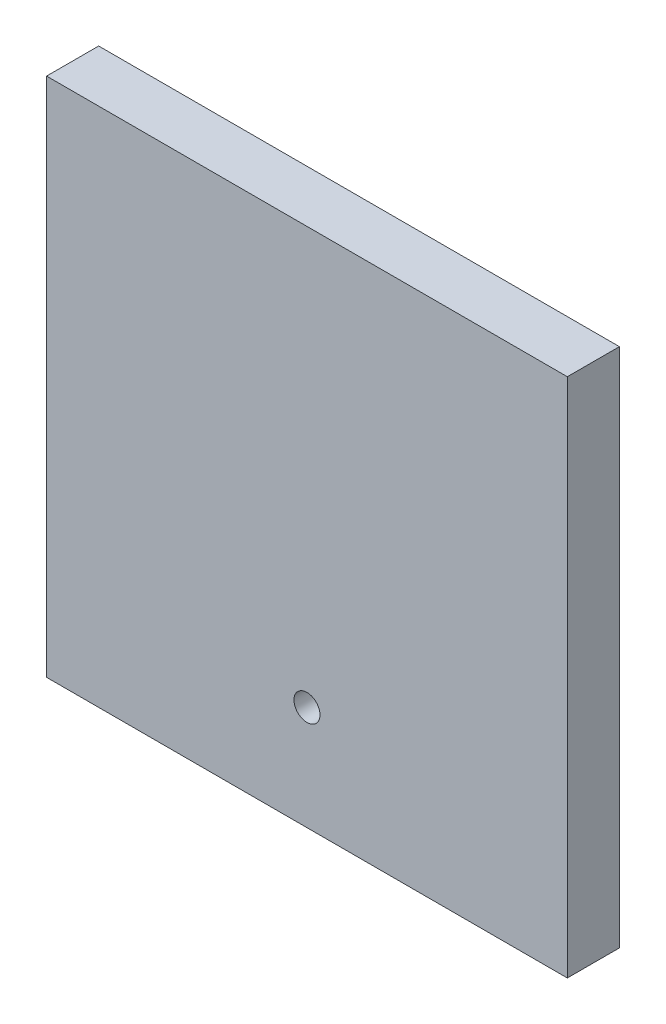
ISO-10303-21;
HEADER;
FILE_DESCRIPTION(('STEP AP214'),'2;1');
FILE_NAME('part.step','',(''),(''),'','','');
FILE_SCHEMA(('AUTOMOTIVE_DESIGN { 1 0 10303 214 1 1 1 1 }'));
ENDSEC;
DATA;
#1=APPLICATION_CONTEXT('core data for automotive mechanical design processes');
#2=APPLICATION_PROTOCOL_DEFINITION('international standard','automotive_design',2000,#1);
#3=PRODUCT_CONTEXT('',#1,'mechanical');
#4=PRODUCT('Part','Part','',(#3));
#5=PRODUCT_RELATED_PRODUCT_CATEGORY('part','',(#4));
#6=PRODUCT_DEFINITION_FORMATION('','',#4);
#7=PRODUCT_DEFINITION_CONTEXT('part definition',#1,'design');
#8=PRODUCT_DEFINITION('design','',#6,#7);
#9=PRODUCT_DEFINITION_SHAPE('','',#8);
#10=(LENGTH_UNIT() NAMED_UNIT(*) SI_UNIT(.MILLI.,.METRE.));
#11=(NAMED_UNIT(*) PLANE_ANGLE_UNIT() SI_UNIT($,.RADIAN.));
#12=(NAMED_UNIT(*) SI_UNIT($,.STERADIAN.) SOLID_ANGLE_UNIT());
#13=UNCERTAINTY_MEASURE_WITH_UNIT(LENGTH_MEASURE(1.E-05),#10,'distance_accuracy_value','');
#14=(GEOMETRIC_REPRESENTATION_CONTEXT(3) GLOBAL_UNCERTAINTY_ASSIGNED_CONTEXT((#13)) GLOBAL_UNIT_ASSIGNED_CONTEXT((#10,
#11,#12)) REPRESENTATION_CONTEXT('',''));
#15=CARTESIAN_POINT('',(0.,0.,0.));
#16=DIRECTION('',(0.,0.,1.));
#17=DIRECTION('',(1.,0.,0.));
#18=AXIS2_PLACEMENT_3D('',#15,#16,#17);
#19=CARTESIAN_POINT('',(0.,0.,10.));
#20=DIRECTION('',(1.,0.,0.));
#21=DIRECTION('',(0.,0.,-1.));
#22=AXIS2_PLACEMENT_3D('',#19,#20,#21);
#23=PLANE('',#22);
#24=DIRECTION('',(0.,-1.,0.));
#25=VECTOR('',#24,1.);
#26=CARTESIAN_POINT('',(0.,0.,0.));
#27=LINE('',#26,#25);
#28=CARTESIAN_POINT('',(0.,100.,0.));
#29=VERTEX_POINT('',#28);
#30=CARTESIAN_POINT('',(0.,0.,0.));
#31=VERTEX_POINT('',#30);
#32=EDGE_CURVE('E98',#29,#31,#27,.T.);
#33=ORIENTED_EDGE('',*,*,#32,.T.);
#34=DIRECTION('',(0.,0.,-1.));
#35=VECTOR('',#34,1.);
#36=CARTESIAN_POINT('',(0.,0.,10.));
#37=LINE('',#36,#35);
#38=CARTESIAN_POINT('',(0.,0.,10.));
#39=VERTEX_POINT('',#38);
#40=EDGE_CURVE('E11',#39,#31,#37,.T.);
#41=ORIENTED_EDGE('',*,*,#40,.F.);
#42=DIRECTION('',(0.,-1.,0.));
#43=VECTOR('',#42,1.);
#44=CARTESIAN_POINT('',(0.,0.,10.));
#45=LINE('',#44,#43);
#46=CARTESIAN_POINT('',(0.,100.,10.));
#47=VERTEX_POINT('',#46);
#48=EDGE_CURVE('E86',#47,#39,#45,.T.);
#49=ORIENTED_EDGE('',*,*,#48,.F.);
#50=DIRECTION('',(0.,0.,-1.));
#51=VECTOR('',#50,1.);
#52=CARTESIAN_POINT('',(0.,100.,10.));
#53=LINE('',#52,#51);
#54=EDGE_CURVE('E94',#47,#29,#53,.T.);
#55=ORIENTED_EDGE('',*,*,#54,.T.);
#56=EDGE_LOOP('',(#33,#41,#49,#55));
#57=FACE_BOUND('',#56,.T.);
#58=ADVANCED_FACE('F35',(#57),#23,.F.);
#59=CARTESIAN_POINT('',(0.,0.,10.));
#60=DIRECTION('',(0.,1.,0.));
#61=DIRECTION('',(0.,0.,1.));
#62=AXIS2_PLACEMENT_3D('',#59,#60,#61);
#63=PLANE('',#62);
#64=DIRECTION('',(1.,0.,0.));
#65=VECTOR('',#64,1.);
#66=CARTESIAN_POINT('',(0.,0.,0.));
#67=LINE('',#66,#65);
#68=CARTESIAN_POINT('',(100.,0.,0.));
#69=VERTEX_POINT('',#68);
#70=EDGE_CURVE('E90',#31,#69,#67,.T.);
#71=ORIENTED_EDGE('',*,*,#70,.T.);
#72=DIRECTION('',(0.,0.,-1.));
#73=VECTOR('',#72,1.);
#74=CARTESIAN_POINT('',(100.,0.,10.));
#75=LINE('',#74,#73);
#76=CARTESIAN_POINT('',(100.,0.,10.));
#77=VERTEX_POINT('',#76);
#78=EDGE_CURVE('E43',#77,#69,#75,.T.);
#79=ORIENTED_EDGE('',*,*,#78,.F.);
#80=DIRECTION('',(1.,0.,0.));
#81=VECTOR('',#80,1.);
#82=CARTESIAN_POINT('',(0.,0.,10.));
#83=LINE('',#82,#81);
#84=EDGE_CURVE('E81',#39,#77,#83,.T.);
#85=ORIENTED_EDGE('',*,*,#84,.F.);
#86=ORIENTED_EDGE('',*,*,#40,.T.);
#87=EDGE_LOOP('',(#71,#79,#85,#86));
#88=FACE_BOUND('',#87,.T.);
#89=ADVANCED_FACE('F89',(#88),#63,.F.);
#90=CARTESIAN_POINT('',(100.,0.,10.));
#91=DIRECTION('',(-1.,0.,0.));
#92=DIRECTION('',(0.,0.,1.));
#93=AXIS2_PLACEMENT_3D('',#90,#91,#92);
#94=PLANE('',#93);
#95=DIRECTION('',(0.,1.,0.));
#96=VECTOR('',#95,1.);
#97=CARTESIAN_POINT('',(100.,0.,0.));
#98=LINE('',#97,#96);
#99=CARTESIAN_POINT('',(100.,100.,0.));
#100=VERTEX_POINT('',#99);
#101=EDGE_CURVE('E68',#69,#100,#98,.T.);
#102=ORIENTED_EDGE('',*,*,#101,.T.);
#103=DIRECTION('',(0.,0.,-1.));
#104=VECTOR('',#103,1.);
#105=CARTESIAN_POINT('',(100.,100.,10.));
#106=LINE('',#105,#104);
#107=CARTESIAN_POINT('',(100.,100.,10.));
#108=VERTEX_POINT('',#107);
#109=EDGE_CURVE('E91',#108,#100,#106,.T.);
#110=ORIENTED_EDGE('',*,*,#109,.F.);
#111=DIRECTION('',(0.,1.,0.));
#112=VECTOR('',#111,1.);
#113=CARTESIAN_POINT('',(100.,0.,10.));
#114=LINE('',#113,#112);
#115=EDGE_CURVE('E84',#77,#108,#114,.T.);
#116=ORIENTED_EDGE('',*,*,#115,.F.);
#117=ORIENTED_EDGE('',*,*,#78,.T.);
#118=EDGE_LOOP('',(#102,#110,#116,#117));
#119=FACE_BOUND('',#118,.T.);
#120=ADVANCED_FACE('F92',(#119),#94,.F.);
#121=CARTESIAN_POINT('',(0.,100.,10.));
#122=DIRECTION('',(0.,-1.,0.));
#123=DIRECTION('',(0.,0.,-1.));
#124=AXIS2_PLACEMENT_3D('',#121,#122,#123);
#125=PLANE('',#124);
#126=DIRECTION('',(-1.,0.,0.));
#127=VECTOR('',#126,1.);
#128=CARTESIAN_POINT('',(0.,100.,0.));
#129=LINE('',#128,#127);
#130=EDGE_CURVE('E74',#100,#29,#129,.T.);
#131=ORIENTED_EDGE('',*,*,#130,.T.);
#132=ORIENTED_EDGE('',*,*,#54,.F.);
#133=DIRECTION('',(-1.,0.,0.));
#134=VECTOR('',#133,1.);
#135=CARTESIAN_POINT('',(0.,100.,10.));
#136=LINE('',#135,#134);
#137=EDGE_CURVE('E51',#108,#47,#136,.T.);
#138=ORIENTED_EDGE('',*,*,#137,.F.);
#139=ORIENTED_EDGE('',*,*,#109,.T.);
#140=EDGE_LOOP('',(#131,#132,#138,#139));
#141=FACE_BOUND('',#140,.T.);
#142=ADVANCED_FACE('F106',(#141),#125,.F.);
#143=CARTESIAN_POINT('',(0.,0.,10.));
#144=DIRECTION('',(0.,0.,-1.));
#145=DIRECTION('',(-1.,0.,0.));
#146=AXIS2_PLACEMENT_3D('',#143,#144,#145);
#147=PLANE('',#146);
#148=CARTESIAN_POINT('',(50.,20.,10.));
#149=DIRECTION('',(0.,0.,1.));
#150=DIRECTION('',(1.,0.,0.));
#151=AXIS2_PLACEMENT_3D('',#148,#149,#150);
#152=CIRCLE('',#151,2.49999999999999);
#153=CARTESIAN_POINT('',(52.5,20.,10.));
#154=VERTEX_POINT('',#153);
#155=EDGE_CURVE('E112',#154,#154,#152,.T.);
#156=ORIENTED_EDGE('',*,*,#155,.F.);
#157=EDGE_LOOP('',(#156));
#158=FACE_BOUND('',#157,.T.);
#159=ORIENTED_EDGE('',*,*,#48,.T.);
#160=ORIENTED_EDGE('',*,*,#84,.T.);
#161=ORIENTED_EDGE('',*,*,#115,.T.);
#162=ORIENTED_EDGE('',*,*,#137,.T.);
#163=EDGE_LOOP('',(#159,#160,#161,#162));
#164=FACE_BOUND('',#163,.T.);
#165=ADVANCED_FACE('F82',(#158,#164),#147,.F.);
#166=CARTESIAN_POINT('',(0.,0.,0.));
#167=DIRECTION('',(0.,0.,-1.));
#168=DIRECTION('',(-1.,0.,0.));
#169=AXIS2_PLACEMENT_3D('',#166,#167,#168);
#170=PLANE('',#169);
#171=CARTESIAN_POINT('',(50.,20.,0.));
#172=DIRECTION('',(0.,0.,1.));
#173=DIRECTION('',(1.,0.,0.));
#174=AXIS2_PLACEMENT_3D('',#171,#172,#173);
#175=CIRCLE('',#174,2.49999999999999);
#176=CARTESIAN_POINT('',(52.5,20.,0.));
#177=VERTEX_POINT('',#176);
#178=EDGE_CURVE('E101',#177,#177,#175,.T.);
#179=ORIENTED_EDGE('',*,*,#178,.T.);
#180=EDGE_LOOP('',(#179));
#181=FACE_BOUND('',#180,.T.);
#182=ORIENTED_EDGE('',*,*,#32,.F.);
#183=ORIENTED_EDGE('',*,*,#130,.F.);
#184=ORIENTED_EDGE('',*,*,#101,.F.);
#185=ORIENTED_EDGE('',*,*,#70,.F.);
#186=EDGE_LOOP('',(#182,#183,#184,#185));
#187=FACE_BOUND('',#186,.T.);
#188=ADVANCED_FACE('F109',(#181,#187),#170,.T.);
#189=CARTESIAN_POINT('',(50.,20.,0.));
#190=DIRECTION('',(0.,0.,1.));
#191=DIRECTION('',(1.,0.,0.));
#192=AXIS2_PLACEMENT_3D('',#189,#190,#191);
#193=CYLINDRICAL_SURFACE('',#192,2.49999999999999);
#194=ORIENTED_EDGE('',*,*,#178,.F.);
#195=EDGE_LOOP('',(#194));
#196=FACE_BOUND('',#195,.T.);
#197=ORIENTED_EDGE('',*,*,#155,.T.);
#198=EDGE_LOOP('',(#197));
#199=FACE_BOUND('',#198,.T.);
#200=ADVANCED_FACE('F119',(#196,#199),#193,.F.);
#201=CLOSED_SHELL('',(#58,#89,#120,#142,#165,#188,#200));
#202=MANIFOLD_SOLID_BREP('B2',#201);
#203=ADVANCED_BREP_SHAPE_REPRESENTATION('',(#18,#202),#14);
#204=SHAPE_DEFINITION_REPRESENTATION(#9,#203);
ENDSEC;
END-ISO-10303-21;
